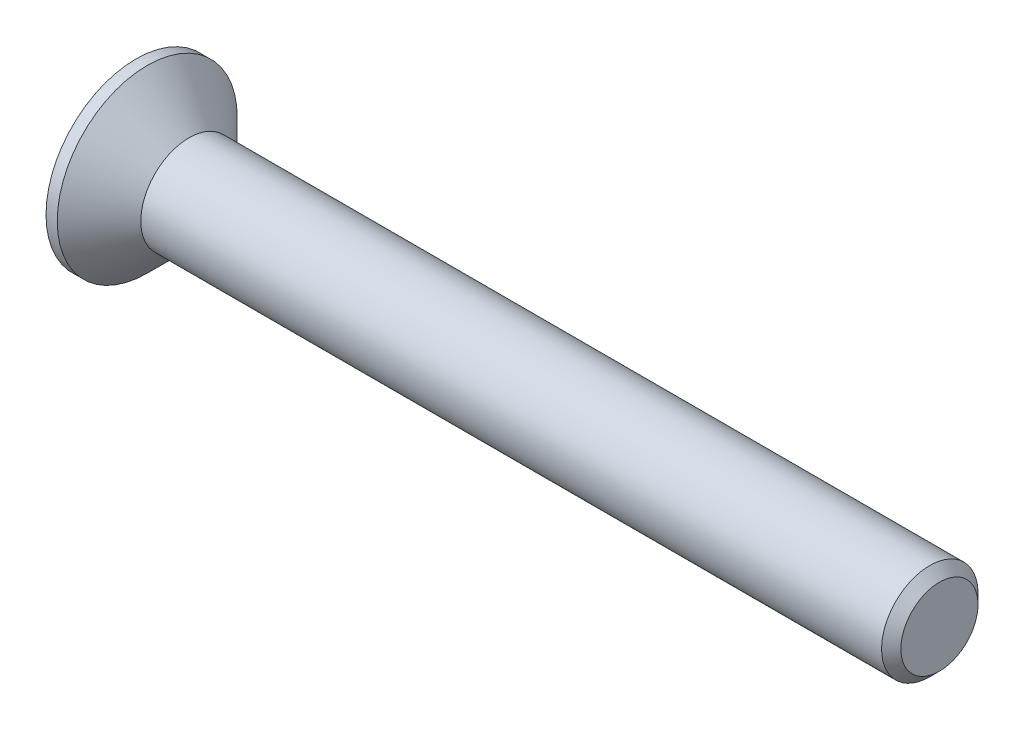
ISO-10303-21;
HEADER;
FILE_DESCRIPTION(('STEP AP214'),'2;1');
FILE_NAME('part.step','',(''),(''),'','','');
FILE_SCHEMA(('AUTOMOTIVE_DESIGN { 1 0 10303 214 1 1 1 1 }'));
ENDSEC;
DATA;
#1=APPLICATION_CONTEXT('core data for automotive mechanical design processes');
#2=APPLICATION_PROTOCOL_DEFINITION('international standard','automotive_design',2000,#1);
#3=PRODUCT_CONTEXT('',#1,'mechanical');
#4=PRODUCT('Part','Part','',(#3));
#5=PRODUCT_RELATED_PRODUCT_CATEGORY('part','',(#4));
#6=PRODUCT_DEFINITION_FORMATION('','',#4);
#7=PRODUCT_DEFINITION_CONTEXT('part definition',#1,'design');
#8=PRODUCT_DEFINITION('design','',#6,#7);
#9=PRODUCT_DEFINITION_SHAPE('','',#8);
#10=(LENGTH_UNIT() NAMED_UNIT(*) SI_UNIT(.MILLI.,.METRE.));
#11=(NAMED_UNIT(*) PLANE_ANGLE_UNIT() SI_UNIT($,.RADIAN.));
#12=(NAMED_UNIT(*) SI_UNIT($,.STERADIAN.) SOLID_ANGLE_UNIT());
#13=UNCERTAINTY_MEASURE_WITH_UNIT(LENGTH_MEASURE(1.E-05),#10,'distance_accuracy_value','');
#14=(GEOMETRIC_REPRESENTATION_CONTEXT(3) GLOBAL_UNCERTAINTY_ASSIGNED_CONTEXT((#13)) GLOBAL_UNIT_ASSIGNED_CONTEXT((#10,
#11,#12)) REPRESENTATION_CONTEXT('',''));
#15=CARTESIAN_POINT('',(0.,0.,0.));
#16=DIRECTION('',(0.,0.,1.));
#17=DIRECTION('',(1.,0.,0.));
#18=AXIS2_PLACEMENT_3D('',#15,#16,#17);
#19=CARTESIAN_POINT('',(0.,0.,0.));
#20=DIRECTION('',(-1.,0.,0.));
#21=DIRECTION('',(0.,-1.,0.));
#22=AXIS2_PLACEMENT_3D('',#19,#20,#21);
#23=CONICAL_SURFACE('',#22,1.5,0.78539816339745);
#24=CARTESIAN_POINT('',(-1.3,0.,0.));
#25=DIRECTION('',(-1.,0.,0.));
#26=DIRECTION('',(0.,-1.,0.));
#27=AXIS2_PLACEMENT_3D('',#24,#25,#26);
#28=CIRCLE('',#27,2.8);
#29=CARTESIAN_POINT('',(-1.3,-2.8,0.));
#30=VERTEX_POINT('',#29);
#31=EDGE_CURVE('E189',#30,#30,#28,.T.);
#32=ORIENTED_EDGE('',*,*,#31,.F.);
#33=EDGE_LOOP('',(#32));
#34=FACE_BOUND('',#33,.T.);
#35=CARTESIAN_POINT('',(0.,0.,0.));
#36=DIRECTION('',(-1.,0.,0.));
#37=DIRECTION('',(0.,-1.,0.));
#38=AXIS2_PLACEMENT_3D('',#35,#36,#37);
#39=CIRCLE('',#38,1.5);
#40=CARTESIAN_POINT('',(0.,-1.5,0.));
#41=VERTEX_POINT('',#40);
#42=EDGE_CURVE('E212',#41,#41,#39,.T.);
#43=ORIENTED_EDGE('',*,*,#42,.T.);
#44=EDGE_LOOP('',(#43));
#45=FACE_BOUND('',#44,.T.);
#46=ADVANCED_FACE('F33',(#34,#45),#23,.T.);
#47=CARTESIAN_POINT('',(-1.65,0.,0.));
#48=DIRECTION('',(-1.,0.,0.));
#49=DIRECTION('',(0.,-1.,0.));
#50=AXIS2_PLACEMENT_3D('',#47,#48,#49);
#51=CYLINDRICAL_SURFACE('',#50,1.5);
#52=CARTESIAN_POINT('',(23.05,0.,0.));
#53=DIRECTION('',(-1.,0.,0.));
#54=DIRECTION('',(0.,-1.,0.));
#55=AXIS2_PLACEMENT_3D('',#52,#53,#54);
#56=CIRCLE('',#55,1.5);
#57=CARTESIAN_POINT('',(23.05,-1.5,0.));
#58=VERTEX_POINT('',#57);
#59=EDGE_CURVE('E41',#58,#58,#56,.T.);
#60=ORIENTED_EDGE('',*,*,#59,.T.);
#61=EDGE_LOOP('',(#60));
#62=FACE_BOUND('',#61,.T.);
#63=ORIENTED_EDGE('',*,*,#42,.F.);
#64=EDGE_LOOP('',(#63));
#65=FACE_BOUND('',#64,.T.);
#66=ADVANCED_FACE('F217',(#62,#65),#51,.T.);
#67=CARTESIAN_POINT('',(23.35,0.,0.));
#68=DIRECTION('',(-1.,0.,0.));
#69=DIRECTION('',(0.,-1.,0.));
#70=AXIS2_PLACEMENT_3D('',#67,#68,#69);
#71=PLANE('',#70);
#72=CARTESIAN_POINT('',(23.35,0.,0.));
#73=DIRECTION('',(-1.,0.,0.));
#74=DIRECTION('',(0.,-1.,0.));
#75=AXIS2_PLACEMENT_3D('',#72,#73,#74);
#76=CIRCLE('',#75,1.2);
#77=CARTESIAN_POINT('',(23.35,-1.2,0.));
#78=VERTEX_POINT('',#77);
#79=EDGE_CURVE('E11',#78,#78,#76,.F.);
#80=ORIENTED_EDGE('',*,*,#79,.T.);
#81=EDGE_LOOP('',(#80));
#82=FACE_BOUND('',#81,.T.);
#83=ADVANCED_FACE('F239',(#82),#71,.F.);
#84=CARTESIAN_POINT('',(-1.65,2.8,0.));
#85=DIRECTION('',(1.,0.,0.));
#86=DIRECTION('',(0.,1.,0.));
#87=AXIS2_PLACEMENT_3D('',#84,#85,#86);
#88=PLANE('',#87);
#89=DIRECTION('',(0.,0.,-1.));
#90=VECTOR('',#89,1.);
#91=CARTESIAN_POINT('',(-1.65,0.365,-1.45));
#92=LINE('',#91,#90);
#93=CARTESIAN_POINT('',(-1.65,0.365,-0.365));
#94=VERTEX_POINT('',#93);
#95=CARTESIAN_POINT('',(-1.65,0.365,-1.45));
#96=VERTEX_POINT('',#95);
#97=EDGE_CURVE('E158',#94,#96,#92,.T.);
#98=ORIENTED_EDGE('',*,*,#97,.F.);
#99=DIRECTION('',(0.,-1.,0.));
#100=VECTOR('',#99,1.);
#101=CARTESIAN_POINT('',(-1.65,0.365,-0.365));
#102=LINE('',#101,#100);
#103=CARTESIAN_POINT('',(-1.65,1.45,-0.365));
#104=VERTEX_POINT('',#103);
#105=EDGE_CURVE('E48',#104,#94,#102,.T.);
#106=ORIENTED_EDGE('',*,*,#105,.F.);
#107=DIRECTION('',(0.,0.,-1.));
#108=VECTOR('',#107,1.);
#109=CARTESIAN_POINT('',(-1.65,1.45,-0.365));
#110=LINE('',#109,#108);
#111=CARTESIAN_POINT('',(-1.65,1.45,0.365));
#112=VERTEX_POINT('',#111);
#113=EDGE_CURVE('E185',#112,#104,#110,.T.);
#114=ORIENTED_EDGE('',*,*,#113,.F.);
#115=DIRECTION('',(0.,1.,0.));
#116=VECTOR('',#115,1.);
#117=CARTESIAN_POINT('',(-1.65,1.45,0.365));
#118=LINE('',#117,#116);
#119=CARTESIAN_POINT('',(-1.65,0.365,0.365));
#120=VERTEX_POINT('',#119);
#121=EDGE_CURVE('E183',#120,#112,#118,.T.);
#122=ORIENTED_EDGE('',*,*,#121,.F.);
#123=DIRECTION('',(0.,0.,-1.));
#124=VECTOR('',#123,1.);
#125=CARTESIAN_POINT('',(-1.65,0.365,0.365));
#126=LINE('',#125,#124);
#127=CARTESIAN_POINT('',(-1.65,0.365,1.45));
#128=VERTEX_POINT('',#127);
#129=EDGE_CURVE('E132',#128,#120,#126,.T.);
#130=ORIENTED_EDGE('',*,*,#129,.F.);
#131=DIRECTION('',(0.,1.,0.));
#132=VECTOR('',#131,1.);
#133=CARTESIAN_POINT('',(-1.65,0.365,1.45));
#134=LINE('',#133,#132);
#135=CARTESIAN_POINT('',(-1.65,-0.365,1.45));
#136=VERTEX_POINT('',#135);
#137=EDGE_CURVE('E179',#136,#128,#134,.T.);
#138=ORIENTED_EDGE('',*,*,#137,.F.);
#139=DIRECTION('',(0.,0.,1.));
#140=VECTOR('',#139,1.);
#141=CARTESIAN_POINT('',(-1.65,-0.365,1.45));
#142=LINE('',#141,#140);
#143=CARTESIAN_POINT('',(-1.65,-0.365,0.365));
#144=VERTEX_POINT('',#143);
#145=EDGE_CURVE('E176',#144,#136,#142,.T.);
#146=ORIENTED_EDGE('',*,*,#145,.F.);
#147=DIRECTION('',(0.,1.,0.));
#148=VECTOR('',#147,1.);
#149=CARTESIAN_POINT('',(-1.65,-0.365,0.365));
#150=LINE('',#149,#148);
#151=CARTESIAN_POINT('',(-1.65,-1.45,0.365));
#152=VERTEX_POINT('',#151);
#153=EDGE_CURVE('E173',#152,#144,#150,.T.);
#154=ORIENTED_EDGE('',*,*,#153,.F.);
#155=DIRECTION('',(0.,0.,1.));
#156=VECTOR('',#155,1.);
#157=CARTESIAN_POINT('',(-1.65,-1.45,0.365));
#158=LINE('',#157,#156);
#159=CARTESIAN_POINT('',(-1.65,-1.45,-0.365));
#160=VERTEX_POINT('',#159);
#161=EDGE_CURVE('E170',#160,#152,#158,.T.);
#162=ORIENTED_EDGE('',*,*,#161,.F.);
#163=DIRECTION('',(0.,-1.,0.));
#164=VECTOR('',#163,1.);
#165=CARTESIAN_POINT('',(-1.65,-1.45,-0.365));
#166=LINE('',#165,#164);
#167=CARTESIAN_POINT('',(-1.65,-0.365,-0.365));
#168=VERTEX_POINT('',#167);
#169=EDGE_CURVE('E167',#168,#160,#166,.T.);
#170=ORIENTED_EDGE('',*,*,#169,.F.);
#171=DIRECTION('',(0.,0.,1.));
#172=VECTOR('',#171,1.);
#173=CARTESIAN_POINT('',(-1.65,-0.365,-0.365));
#174=LINE('',#173,#172);
#175=CARTESIAN_POINT('',(-1.65,-0.365,-1.45));
#176=VERTEX_POINT('',#175);
#177=EDGE_CURVE('E164',#176,#168,#174,.T.);
#178=ORIENTED_EDGE('',*,*,#177,.F.);
#179=DIRECTION('',(0.,-1.,0.));
#180=VECTOR('',#179,1.);
#181=CARTESIAN_POINT('',(-1.65,-0.365,-1.45));
#182=LINE('',#181,#180);
#183=EDGE_CURVE('E161',#96,#176,#182,.T.);
#184=ORIENTED_EDGE('',*,*,#183,.F.);
#185=EDGE_LOOP('',(#98,#106,#114,#122,#130,#138,#146,#154,#162,#170,#178,#184));
#186=FACE_BOUND('',#185,.T.);
#187=CARTESIAN_POINT('',(-1.65,0.,0.));
#188=DIRECTION('',(-1.,0.,0.));
#189=DIRECTION('',(0.,-1.,0.));
#190=AXIS2_PLACEMENT_3D('',#187,#188,#189);
#191=CIRCLE('',#190,2.8);
#192=CARTESIAN_POINT('',(-1.65,-2.8,0.));
#193=VERTEX_POINT('',#192);
#194=EDGE_CURVE('E209',#193,#193,#191,.T.);
#195=ORIENTED_EDGE('',*,*,#194,.T.);
#196=EDGE_LOOP('',(#195));
#197=FACE_BOUND('',#196,.T.);
#198=ADVANCED_FACE('F230',(#186,#197),#88,.F.);
#199=CARTESIAN_POINT('',(-1.65,0.,0.));
#200=DIRECTION('',(-1.,0.,0.));
#201=DIRECTION('',(0.,-1.,0.));
#202=AXIS2_PLACEMENT_3D('',#199,#200,#201);
#203=CYLINDRICAL_SURFACE('',#202,2.8);
#204=ORIENTED_EDGE('',*,*,#194,.F.);
#205=EDGE_LOOP('',(#204));
#206=FACE_BOUND('',#205,.T.);
#207=ORIENTED_EDGE('',*,*,#31,.T.);
#208=EDGE_LOOP('',(#207));
#209=FACE_BOUND('',#208,.T.);
#210=ADVANCED_FACE('F222',(#206,#209),#203,.T.);
#211=CARTESIAN_POINT('',(23.05,0.,0.));
#212=DIRECTION('',(-1.,0.,0.));
#213=DIRECTION('',(0.,-1.,0.));
#214=AXIS2_PLACEMENT_3D('',#211,#212,#213);
#215=CONICAL_SURFACE('',#214,1.5,0.785398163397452);
#216=ORIENTED_EDGE('',*,*,#79,.F.);
#217=EDGE_LOOP('',(#216));
#218=FACE_BOUND('',#217,.T.);
#219=ORIENTED_EDGE('',*,*,#59,.F.);
#220=EDGE_LOOP('',(#219));
#221=FACE_BOUND('',#220,.T.);
#222=ADVANCED_FACE('F35',(#218,#221),#215,.T.);
#223=CARTESIAN_POINT('',(-0.4,0.365,-0.365));
#224=DIRECTION('',(0.,0.,-1.));
#225=DIRECTION('',(-1.,0.,0.));
#226=AXIS2_PLACEMENT_3D('',#223,#224,#225);
#227=PLANE('',#226);
#228=ORIENTED_EDGE('',*,*,#105,.T.);
#229=DIRECTION('',(-1.,0.,0.));
#230=VECTOR('',#229,1.);
#231=CARTESIAN_POINT('',(-0.4,0.365,-0.365));
#232=LINE('',#231,#230);
#233=CARTESIAN_POINT('',(-0.4,0.365,-0.365));
#234=VERTEX_POINT('',#233);
#235=EDGE_CURVE('E96',#234,#94,#232,.T.);
#236=ORIENTED_EDGE('',*,*,#235,.F.);
#237=DIRECTION('',(0.,-1.,0.));
#238=VECTOR('',#237,1.);
#239=CARTESIAN_POINT('',(-0.4,0.365,-0.365));
#240=LINE('',#239,#238);
#241=CARTESIAN_POINT('',(-0.4,1.45,-0.365));
#242=VERTEX_POINT('',#241);
#243=EDGE_CURVE('E187',#242,#234,#240,.T.);
#244=ORIENTED_EDGE('',*,*,#243,.F.);
#245=DIRECTION('',(-1.,0.,0.));
#246=VECTOR('',#245,1.);
#247=CARTESIAN_POINT('',(-0.4,1.45,-0.365));
#248=LINE('',#247,#246);
#249=EDGE_CURVE('E56',#242,#104,#248,.T.);
#250=ORIENTED_EDGE('',*,*,#249,.T.);
#251=EDGE_LOOP('',(#228,#236,#244,#250));
#252=FACE_BOUND('',#251,.T.);
#253=ADVANCED_FACE('F221',(#252),#227,.F.);
#254=CARTESIAN_POINT('',(-0.4,1.45,-0.365));
#255=DIRECTION('',(0.,1.,0.));
#256=DIRECTION('',(-1.,0.,0.));
#257=AXIS2_PLACEMENT_3D('',#254,#255,#256);
#258=PLANE('',#257);
#259=ORIENTED_EDGE('',*,*,#113,.T.);
#260=ORIENTED_EDGE('',*,*,#249,.F.);
#261=DIRECTION('',(0.,0.,-1.));
#262=VECTOR('',#261,1.);
#263=CARTESIAN_POINT('',(-0.4,1.45,-0.365));
#264=LINE('',#263,#262);
#265=CARTESIAN_POINT('',(-0.4,1.45,0.365));
#266=VERTEX_POINT('',#265);
#267=EDGE_CURVE('E144',#266,#242,#264,.T.);
#268=ORIENTED_EDGE('',*,*,#267,.F.);
#269=DIRECTION('',(-1.,0.,0.));
#270=VECTOR('',#269,1.);
#271=CARTESIAN_POINT('',(-0.4,1.45,0.365));
#272=LINE('',#271,#270);
#273=EDGE_CURVE('E136',#266,#112,#272,.T.);
#274=ORIENTED_EDGE('',*,*,#273,.T.);
#275=EDGE_LOOP('',(#259,#260,#268,#274));
#276=FACE_BOUND('',#275,.T.);
#277=ADVANCED_FACE('F228',(#276),#258,.F.);
#278=CARTESIAN_POINT('',(-0.4,1.45,0.365));
#279=DIRECTION('',(0.,0.,1.));
#280=DIRECTION('',(1.,0.,0.));
#281=AXIS2_PLACEMENT_3D('',#278,#279,#280);
#282=PLANE('',#281);
#283=ORIENTED_EDGE('',*,*,#121,.T.);
#284=ORIENTED_EDGE('',*,*,#273,.F.);
#285=DIRECTION('',(0.,1.,0.));
#286=VECTOR('',#285,1.);
#287=CARTESIAN_POINT('',(-0.4,1.45,0.365));
#288=LINE('',#287,#286);
#289=CARTESIAN_POINT('',(-0.4,0.365,0.365));
#290=VERTEX_POINT('',#289);
#291=EDGE_CURVE('E140',#290,#266,#288,.T.);
#292=ORIENTED_EDGE('',*,*,#291,.F.);
#293=DIRECTION('',(-1.,0.,0.));
#294=VECTOR('',#293,1.);
#295=CARTESIAN_POINT('',(-0.4,0.365,0.365));
#296=LINE('',#295,#294);
#297=EDGE_CURVE('E125',#290,#120,#296,.T.);
#298=ORIENTED_EDGE('',*,*,#297,.T.);
#299=EDGE_LOOP('',(#283,#284,#292,#298));
#300=FACE_BOUND('',#299,.T.);
#301=ADVANCED_FACE('F141',(#300),#282,.F.);
#302=CARTESIAN_POINT('',(-0.4,0.365,0.365));
#303=DIRECTION('',(0.,1.,0.));
#304=DIRECTION('',(-1.,0.,0.));
#305=AXIS2_PLACEMENT_3D('',#302,#303,#304);
#306=PLANE('',#305);
#307=ORIENTED_EDGE('',*,*,#129,.T.);
#308=ORIENTED_EDGE('',*,*,#297,.F.);
#309=DIRECTION('',(0.,0.,-1.));
#310=VECTOR('',#309,1.);
#311=CARTESIAN_POINT('',(-0.4,0.365,0.365));
#312=LINE('',#311,#310);
#313=CARTESIAN_POINT('',(-0.4,0.365,1.45));
#314=VERTEX_POINT('',#313);
#315=EDGE_CURVE('E129',#314,#290,#312,.T.);
#316=ORIENTED_EDGE('',*,*,#315,.F.);
#317=DIRECTION('',(-1.,0.,0.));
#318=VECTOR('',#317,1.);
#319=CARTESIAN_POINT('',(-0.4,0.365,1.45));
#320=LINE('',#319,#318);
#321=EDGE_CURVE('E137',#314,#128,#320,.T.);
#322=ORIENTED_EDGE('',*,*,#321,.T.);
#323=EDGE_LOOP('',(#307,#308,#316,#322));
#324=FACE_BOUND('',#323,.T.);
#325=ADVANCED_FACE('F127',(#324),#306,.F.);
#326=CARTESIAN_POINT('',(-0.4,0.365,1.45));
#327=DIRECTION('',(0.,0.,1.));
#328=DIRECTION('',(1.,0.,0.));
#329=AXIS2_PLACEMENT_3D('',#326,#327,#328);
#330=PLANE('',#329);
#331=ORIENTED_EDGE('',*,*,#137,.T.);
#332=ORIENTED_EDGE('',*,*,#321,.F.);
#333=DIRECTION('',(0.,1.,0.));
#334=VECTOR('',#333,1.);
#335=CARTESIAN_POINT('',(-0.4,0.365,1.45));
#336=LINE('',#335,#334);
#337=CARTESIAN_POINT('',(-0.4,-0.365,1.45));
#338=VERTEX_POINT('',#337);
#339=EDGE_CURVE('E150',#338,#314,#336,.T.);
#340=ORIENTED_EDGE('',*,*,#339,.F.);
#341=DIRECTION('',(-1.,0.,0.));
#342=VECTOR('',#341,1.);
#343=CARTESIAN_POINT('',(-0.4,-0.365,1.45));
#344=LINE('',#343,#342);
#345=EDGE_CURVE('E192',#338,#136,#344,.T.);
#346=ORIENTED_EDGE('',*,*,#345,.T.);
#347=EDGE_LOOP('',(#331,#332,#340,#346));
#348=FACE_BOUND('',#347,.T.);
#349=ADVANCED_FACE('F277',(#348),#330,.F.);
#350=CARTESIAN_POINT('',(-0.4,-0.365,1.45));
#351=DIRECTION('',(0.,-1.,0.));
#352=DIRECTION('',(1.,0.,0.));
#353=AXIS2_PLACEMENT_3D('',#350,#351,#352);
#354=PLANE('',#353);
#355=ORIENTED_EDGE('',*,*,#145,.T.);
#356=ORIENTED_EDGE('',*,*,#345,.F.);
#357=DIRECTION('',(0.,0.,1.));
#358=VECTOR('',#357,1.);
#359=CARTESIAN_POINT('',(-0.4,-0.365,1.45));
#360=LINE('',#359,#358);
#361=CARTESIAN_POINT('',(-0.4,-0.365,0.365));
#362=VERTEX_POINT('',#361);
#363=EDGE_CURVE('E152',#362,#338,#360,.T.);
#364=ORIENTED_EDGE('',*,*,#363,.F.);
#365=DIRECTION('',(-1.,0.,0.));
#366=VECTOR('',#365,1.);
#367=CARTESIAN_POINT('',(-0.4,-0.365,0.365));
#368=LINE('',#367,#366);
#369=EDGE_CURVE('E194',#362,#144,#368,.T.);
#370=ORIENTED_EDGE('',*,*,#369,.T.);
#371=EDGE_LOOP('',(#355,#356,#364,#370));
#372=FACE_BOUND('',#371,.T.);
#373=ADVANCED_FACE('F273',(#372),#354,.F.);
#374=CARTESIAN_POINT('',(-0.4,-0.365,0.365));
#375=DIRECTION('',(0.,0.,1.));
#376=DIRECTION('',(1.,0.,0.));
#377=AXIS2_PLACEMENT_3D('',#374,#375,#376);
#378=PLANE('',#377);
#379=ORIENTED_EDGE('',*,*,#153,.T.);
#380=ORIENTED_EDGE('',*,*,#369,.F.);
#381=DIRECTION('',(0.,1.,0.));
#382=VECTOR('',#381,1.);
#383=CARTESIAN_POINT('',(-0.4,-0.365,0.365));
#384=LINE('',#383,#382);
#385=CARTESIAN_POINT('',(-0.4,-1.45,0.365));
#386=VERTEX_POINT('',#385);
#387=EDGE_CURVE('E422',#386,#362,#384,.T.);
#388=ORIENTED_EDGE('',*,*,#387,.F.);
#389=DIRECTION('',(-1.,0.,0.));
#390=VECTOR('',#389,1.);
#391=CARTESIAN_POINT('',(-0.4,-1.45,0.365));
#392=LINE('',#391,#390);
#393=EDGE_CURVE('E196',#386,#152,#392,.T.);
#394=ORIENTED_EDGE('',*,*,#393,.T.);
#395=EDGE_LOOP('',(#379,#380,#388,#394));
#396=FACE_BOUND('',#395,.T.);
#397=ADVANCED_FACE('F269',(#396),#378,.F.);
#398=CARTESIAN_POINT('',(-0.4,-1.45,0.365));
#399=DIRECTION('',(0.,-1.,0.));
#400=DIRECTION('',(1.,0.,0.));
#401=AXIS2_PLACEMENT_3D('',#398,#399,#400);
#402=PLANE('',#401);
#403=ORIENTED_EDGE('',*,*,#161,.T.);
#404=ORIENTED_EDGE('',*,*,#393,.F.);
#405=DIRECTION('',(0.,0.,1.));
#406=VECTOR('',#405,1.);
#407=CARTESIAN_POINT('',(-0.4,-1.45,0.365));
#408=LINE('',#407,#406);
#409=CARTESIAN_POINT('',(-0.4,-1.45,-0.365));
#410=VERTEX_POINT('',#409);
#411=EDGE_CURVE('E419',#410,#386,#408,.T.);
#412=ORIENTED_EDGE('',*,*,#411,.F.);
#413=DIRECTION('',(-1.,0.,0.));
#414=VECTOR('',#413,1.);
#415=CARTESIAN_POINT('',(-0.4,-1.45,-0.365));
#416=LINE('',#415,#414);
#417=EDGE_CURVE('E198',#410,#160,#416,.T.);
#418=ORIENTED_EDGE('',*,*,#417,.T.);
#419=EDGE_LOOP('',(#403,#404,#412,#418));
#420=FACE_BOUND('',#419,.T.);
#421=ADVANCED_FACE('F265',(#420),#402,.F.);
#422=CARTESIAN_POINT('',(-0.4,-1.45,-0.365));
#423=DIRECTION('',(0.,0.,-1.));
#424=DIRECTION('',(-1.,0.,0.));
#425=AXIS2_PLACEMENT_3D('',#422,#423,#424);
#426=PLANE('',#425);
#427=ORIENTED_EDGE('',*,*,#169,.T.);
#428=ORIENTED_EDGE('',*,*,#417,.F.);
#429=DIRECTION('',(0.,-1.,0.));
#430=VECTOR('',#429,1.);
#431=CARTESIAN_POINT('',(-0.4,-1.45,-0.365));
#432=LINE('',#431,#430);
#433=CARTESIAN_POINT('',(-0.4,-0.365,-0.365));
#434=VERTEX_POINT('',#433);
#435=EDGE_CURVE('E416',#434,#410,#432,.T.);
#436=ORIENTED_EDGE('',*,*,#435,.F.);
#437=DIRECTION('',(-1.,0.,0.));
#438=VECTOR('',#437,1.);
#439=CARTESIAN_POINT('',(-0.4,-0.365,-0.365));
#440=LINE('',#439,#438);
#441=EDGE_CURVE('E200',#434,#168,#440,.T.);
#442=ORIENTED_EDGE('',*,*,#441,.T.);
#443=EDGE_LOOP('',(#427,#428,#436,#442));
#444=FACE_BOUND('',#443,.T.);
#445=ADVANCED_FACE('F261',(#444),#426,.F.);
#446=CARTESIAN_POINT('',(-0.4,-0.365,-0.365));
#447=DIRECTION('',(0.,-1.,0.));
#448=DIRECTION('',(1.,0.,0.));
#449=AXIS2_PLACEMENT_3D('',#446,#447,#448);
#450=PLANE('',#449);
#451=ORIENTED_EDGE('',*,*,#177,.T.);
#452=ORIENTED_EDGE('',*,*,#441,.F.);
#453=DIRECTION('',(0.,0.,1.));
#454=VECTOR('',#453,1.);
#455=CARTESIAN_POINT('',(-0.4,-0.365,-0.365));
#456=LINE('',#455,#454);
#457=CARTESIAN_POINT('',(-0.4,-0.365,-1.45));
#458=VERTEX_POINT('',#457);
#459=EDGE_CURVE('E413',#458,#434,#456,.T.);
#460=ORIENTED_EDGE('',*,*,#459,.F.);
#461=DIRECTION('',(-1.,0.,0.));
#462=VECTOR('',#461,1.);
#463=CARTESIAN_POINT('',(-0.4,-0.365,-1.45));
#464=LINE('',#463,#462);
#465=EDGE_CURVE('E202',#458,#176,#464,.T.);
#466=ORIENTED_EDGE('',*,*,#465,.T.);
#467=EDGE_LOOP('',(#451,#452,#460,#466));
#468=FACE_BOUND('',#467,.T.);
#469=ADVANCED_FACE('F257',(#468),#450,.F.);
#470=CARTESIAN_POINT('',(-0.4,-0.365,-1.45));
#471=DIRECTION('',(0.,0.,-1.));
#472=DIRECTION('',(-1.,0.,0.));
#473=AXIS2_PLACEMENT_3D('',#470,#471,#472);
#474=PLANE('',#473);
#475=ORIENTED_EDGE('',*,*,#183,.T.);
#476=ORIENTED_EDGE('',*,*,#465,.F.);
#477=DIRECTION('',(0.,-1.,0.));
#478=VECTOR('',#477,1.);
#479=CARTESIAN_POINT('',(-0.4,-0.365,-1.45));
#480=LINE('',#479,#478);
#481=CARTESIAN_POINT('',(-0.4,0.365,-1.45));
#482=VERTEX_POINT('',#481);
#483=EDGE_CURVE('E408',#482,#458,#480,.T.);
#484=ORIENTED_EDGE('',*,*,#483,.F.);
#485=DIRECTION('',(-1.,0.,0.));
#486=VECTOR('',#485,1.);
#487=CARTESIAN_POINT('',(-0.4,0.365,-1.45));
#488=LINE('',#487,#486);
#489=EDGE_CURVE('E204',#482,#96,#488,.T.);
#490=ORIENTED_EDGE('',*,*,#489,.T.);
#491=EDGE_LOOP('',(#475,#476,#484,#490));
#492=FACE_BOUND('',#491,.T.);
#493=ADVANCED_FACE('F253',(#492),#474,.F.);
#494=CARTESIAN_POINT('',(-0.4,0.365,-1.45));
#495=DIRECTION('',(0.,1.,0.));
#496=DIRECTION('',(-1.,0.,0.));
#497=AXIS2_PLACEMENT_3D('',#494,#495,#496);
#498=PLANE('',#497);
#499=ORIENTED_EDGE('',*,*,#97,.T.);
#500=ORIENTED_EDGE('',*,*,#489,.F.);
#501=DIRECTION('',(0.,0.,-1.));
#502=VECTOR('',#501,1.);
#503=CARTESIAN_POINT('',(-0.4,0.365,-1.45));
#504=LINE('',#503,#502);
#505=EDGE_CURVE('E406',#234,#482,#504,.T.);
#506=ORIENTED_EDGE('',*,*,#505,.F.);
#507=ORIENTED_EDGE('',*,*,#235,.T.);
#508=EDGE_LOOP('',(#499,#500,#506,#507));
#509=FACE_BOUND('',#508,.T.);
#510=ADVANCED_FACE('F250',(#509),#498,.F.);
#511=CARTESIAN_POINT('',(-0.4,0.,0.));
#512=DIRECTION('',(1.,0.,0.));
#513=DIRECTION('',(0.,0.,-1.));
#514=AXIS2_PLACEMENT_3D('',#511,#512,#513);
#515=PLANE('',#514);
#516=ORIENTED_EDGE('',*,*,#243,.T.);
#517=ORIENTED_EDGE('',*,*,#505,.T.);
#518=ORIENTED_EDGE('',*,*,#483,.T.);
#519=ORIENTED_EDGE('',*,*,#459,.T.);
#520=ORIENTED_EDGE('',*,*,#435,.T.);
#521=ORIENTED_EDGE('',*,*,#411,.T.);
#522=ORIENTED_EDGE('',*,*,#387,.T.);
#523=ORIENTED_EDGE('',*,*,#363,.T.);
#524=ORIENTED_EDGE('',*,*,#339,.T.);
#525=ORIENTED_EDGE('',*,*,#315,.T.);
#526=ORIENTED_EDGE('',*,*,#291,.T.);
#527=ORIENTED_EDGE('',*,*,#267,.T.);
#528=EDGE_LOOP('',(#516,#517,#518,#519,#520,#521,#522,#523,#524,#525,#526,#527));
#529=FACE_BOUND('',#528,.T.);
#530=ADVANCED_FACE('F147',(#529),#515,.F.);
#531=CLOSED_SHELL('',(#46,#66,#83,#198,#210,#222,#253,#277,#301,#325,#349,#373,#397,#421,#445,
#469,#493,#510,#530));
#532=MANIFOLD_SOLID_BREP('B2',#531);
#533=ADVANCED_BREP_SHAPE_REPRESENTATION('',(#18,#532),#14);
#534=SHAPE_DEFINITION_REPRESENTATION(#9,#533);
ENDSEC;
END-ISO-10303-21;
